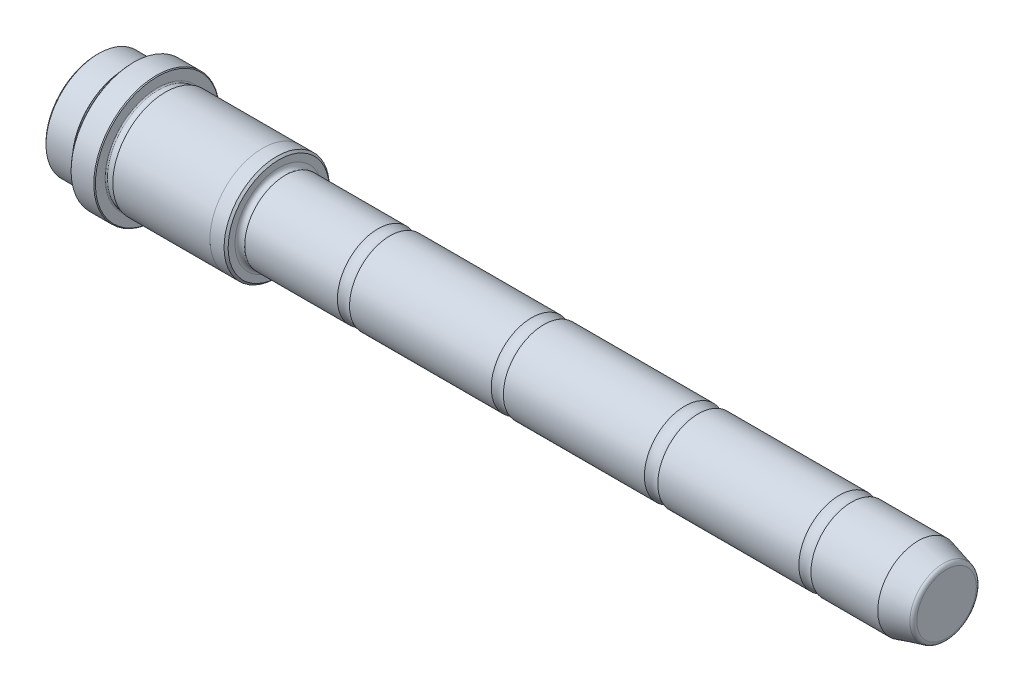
ISO-10303-21;
HEADER;
FILE_DESCRIPTION(('STEP AP214'),'2;1');
FILE_NAME('part.step','',(''),(''),'','','');
FILE_SCHEMA(('AUTOMOTIVE_DESIGN { 1 0 10303 214 1 1 1 1 }'));
ENDSEC;
DATA;
#1=APPLICATION_CONTEXT('core data for automotive mechanical design processes');
#2=APPLICATION_PROTOCOL_DEFINITION('international standard','automotive_design',2000,#1);
#3=PRODUCT_CONTEXT('',#1,'mechanical');
#4=PRODUCT('Part','Part','',(#3));
#5=PRODUCT_RELATED_PRODUCT_CATEGORY('part','',(#4));
#6=PRODUCT_DEFINITION_FORMATION('','',#4);
#7=PRODUCT_DEFINITION_CONTEXT('part definition',#1,'design');
#8=PRODUCT_DEFINITION('design','',#6,#7);
#9=PRODUCT_DEFINITION_SHAPE('','',#8);
#10=(LENGTH_UNIT() NAMED_UNIT(*) SI_UNIT(.MILLI.,.METRE.));
#11=(NAMED_UNIT(*) PLANE_ANGLE_UNIT() SI_UNIT($,.RADIAN.));
#12=(NAMED_UNIT(*) SI_UNIT($,.STERADIAN.) SOLID_ANGLE_UNIT());
#13=UNCERTAINTY_MEASURE_WITH_UNIT(LENGTH_MEASURE(1.E-05),#10,'distance_accuracy_value','');
#14=(GEOMETRIC_REPRESENTATION_CONTEXT(3) GLOBAL_UNCERTAINTY_ASSIGNED_CONTEXT((#13)) GLOBAL_UNIT_ASSIGNED_CONTEXT((#10,
#11,#12)) REPRESENTATION_CONTEXT('',''));
#15=CARTESIAN_POINT('',(0.,0.,0.));
#16=DIRECTION('',(0.,0.,1.));
#17=DIRECTION('',(1.,0.,0.));
#18=AXIS2_PLACEMENT_3D('',#15,#16,#17);
#19=CARTESIAN_POINT('',(165.,0.,0.));
#20=DIRECTION('',(1.,0.,0.));
#21=DIRECTION('',(0.,1.,0.));
#22=AXIS2_PLACEMENT_3D('',#19,#20,#21);
#23=CYLINDRICAL_SURFACE('',#22,9.99999999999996);
#24=CARTESIAN_POINT('',(1.59999999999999,0.,0.));
#25=DIRECTION('',(1.,0.,0.));
#26=DIRECTION('',(0.,1.,0.));
#27=AXIS2_PLACEMENT_3D('',#24,#25,#26);
#28=CIRCLE('',#27,9.99999999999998);
#29=CARTESIAN_POINT('',(1.59999999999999,9.99999999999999,0.));
#30=VERTEX_POINT('',#29);
#31=EDGE_CURVE('E105',#30,#30,#28,.T.);
#32=ORIENTED_EDGE('',*,*,#31,.T.);
#33=EDGE_LOOP('',(#32));
#34=FACE_BOUND('',#33,.T.);
#35=CARTESIAN_POINT('',(24.5033370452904,0.,0.));
#36=DIRECTION('',(-1.,0.,0.));
#37=DIRECTION('',(0.,-1.,0.));
#38=AXIS2_PLACEMENT_3D('',#35,#36,#37);
#39=CIRCLE('',#38,9.99999999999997);
#40=CARTESIAN_POINT('',(24.5033370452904,-9.99999999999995,0.));
#41=VERTEX_POINT('',#40);
#42=EDGE_CURVE('E132',#41,#41,#39,.T.);
#43=ORIENTED_EDGE('',*,*,#42,.T.);
#44=EDGE_LOOP('',(#43));
#45=FACE_BOUND('',#44,.T.);
#46=ADVANCED_FACE('F28',(#34,#45),#23,.T.);
#47=CARTESIAN_POINT('',(-45.,13.,0.));
#48=DIRECTION('',(-1.,0.,0.));
#49=DIRECTION('',(0.,-1.,0.));
#50=AXIS2_PLACEMENT_3D('',#47,#48,#49);
#51=PLANE('',#50);
#52=CARTESIAN_POINT('',(-45.,0.,0.));
#53=DIRECTION('',(-1.,0.,0.));
#54=DIRECTION('',(0.,-1.,0.));
#55=AXIS2_PLACEMENT_3D('',#52,#53,#54);
#56=CIRCLE('',#55,12.5000000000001);
#57=CARTESIAN_POINT('',(-45.,-12.5000000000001,0.));
#58=VERTEX_POINT('',#57);
#59=EDGE_CURVE('E39',#58,#58,#56,.T.);
#60=ORIENTED_EDGE('',*,*,#59,.T.);
#61=EDGE_LOOP('',(#60));
#62=FACE_BOUND('',#61,.T.);
#63=ADVANCED_FACE('F155',(#62),#51,.T.);
#64=CARTESIAN_POINT('',(165.,0.,0.));
#65=DIRECTION('',(1.,0.,0.));
#66=DIRECTION('',(0.,1.,0.));
#67=AXIS2_PLACEMENT_3D('',#64,#65,#66);
#68=CYLINDRICAL_SURFACE('',#67,13.);
#69=CARTESIAN_POINT('',(-44.5000000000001,0.,0.));
#70=DIRECTION('',(-1.,0.,0.));
#71=DIRECTION('',(0.,-1.,0.));
#72=AXIS2_PLACEMENT_3D('',#69,#70,#71);
#73=CIRCLE('',#72,13.);
#74=CARTESIAN_POINT('',(-44.5000000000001,-13.,0.));
#75=VERTEX_POINT('',#74);
#76=EDGE_CURVE('E43',#75,#75,#73,.F.);
#77=ORIENTED_EDGE('',*,*,#76,.T.);
#78=EDGE_LOOP('',(#77));
#79=FACE_BOUND('',#78,.T.);
#80=CARTESIAN_POINT('',(-38.,0.,0.));
#81=DIRECTION('',(1.,0.,0.));
#82=DIRECTION('',(0.,1.,0.));
#83=AXIS2_PLACEMENT_3D('',#80,#81,#82);
#84=CIRCLE('',#83,13.);
#85=CARTESIAN_POINT('',(-38.,13.,0.));
#86=VERTEX_POINT('',#85);
#87=EDGE_CURVE('E66',#86,#86,#84,.T.);
#88=ORIENTED_EDGE('',*,*,#87,.F.);
#89=EDGE_LOOP('',(#88));
#90=FACE_BOUND('',#89,.T.);
#91=ADVANCED_FACE('F163',(#79,#90),#68,.T.);
#92=CARTESIAN_POINT('',(-38.,12.9,0.));
#93=DIRECTION('',(1.,0.,0.));
#94=DIRECTION('',(0.,1.,0.));
#95=AXIS2_PLACEMENT_3D('',#92,#93,#94);
#96=PLANE('',#95);
#97=ORIENTED_EDGE('',*,*,#87,.T.);
#98=EDGE_LOOP('',(#97));
#99=FACE_BOUND('',#98,.T.);
#100=CARTESIAN_POINT('',(-38.,0.,0.));
#101=DIRECTION('',(1.,0.,0.));
#102=DIRECTION('',(0.,1.,0.));
#103=AXIS2_PLACEMENT_3D('',#100,#101,#102);
#104=CIRCLE('',#103,12.9);
#105=CARTESIAN_POINT('',(-38.,12.9,0.));
#106=VERTEX_POINT('',#105);
#107=EDGE_CURVE('E69',#106,#106,#104,.T.);
#108=ORIENTED_EDGE('',*,*,#107,.F.);
#109=EDGE_LOOP('',(#108));
#110=FACE_BOUND('',#109,.T.);
#111=ADVANCED_FACE('F430',(#99,#110),#96,.T.);
#112=CARTESIAN_POINT('',(-37.7,0.,0.));
#113=DIRECTION('',(1.,0.,0.));
#114=DIRECTION('',(0.,1.,0.));
#115=AXIS2_PLACEMENT_3D('',#112,#113,#114);
#116=TOROIDAL_SURFACE('',#115,12.9,0.299999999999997);
#117=ORIENTED_EDGE('',*,*,#107,.T.);
#118=EDGE_LOOP('',(#117));
#119=FACE_BOUND('',#118,.T.);
#120=CARTESIAN_POINT('',(-37.7,0.,0.));
#121=DIRECTION('',(1.,0.,0.));
#122=DIRECTION('',(0.,1.,0.));
#123=AXIS2_PLACEMENT_3D('',#120,#121,#122);
#124=CIRCLE('',#123,12.6);
#125=CARTESIAN_POINT('',(-37.7,12.6,0.));
#126=VERTEX_POINT('',#125);
#127=EDGE_CURVE('E72',#126,#126,#124,.T.);
#128=ORIENTED_EDGE('',*,*,#127,.F.);
#129=EDGE_LOOP('',(#128));
#130=FACE_BOUND('',#129,.T.);
#131=ADVANCED_FACE('F421',(#119,#130),#116,.F.);
#132=CARTESIAN_POINT('',(165.,0.,0.));
#133=DIRECTION('',(1.,0.,0.));
#134=DIRECTION('',(0.,1.,0.));
#135=AXIS2_PLACEMENT_3D('',#132,#133,#134);
#136=CYLINDRICAL_SURFACE('',#135,12.6);
#137=ORIENTED_EDGE('',*,*,#127,.T.);
#138=EDGE_LOOP('',(#137));
#139=FACE_BOUND('',#138,.T.);
#140=CARTESIAN_POINT('',(-36.3,0.,0.));
#141=DIRECTION('',(1.,0.,0.));
#142=DIRECTION('',(0.,1.,0.));
#143=AXIS2_PLACEMENT_3D('',#140,#141,#142);
#144=CIRCLE('',#143,12.6);
#145=CARTESIAN_POINT('',(-36.3,12.6,0.));
#146=VERTEX_POINT('',#145);
#147=EDGE_CURVE('E75',#146,#146,#144,.T.);
#148=ORIENTED_EDGE('',*,*,#147,.F.);
#149=EDGE_LOOP('',(#148));
#150=FACE_BOUND('',#149,.T.);
#151=ADVANCED_FACE('F412',(#139,#150),#136,.T.);
#152=CARTESIAN_POINT('',(-36.3,0.,0.));
#153=DIRECTION('',(1.,0.,0.));
#154=DIRECTION('',(0.,1.,0.));
#155=AXIS2_PLACEMENT_3D('',#152,#153,#154);
#156=TOROIDAL_SURFACE('',#155,12.9,0.300000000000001);
#157=ORIENTED_EDGE('',*,*,#147,.T.);
#158=EDGE_LOOP('',(#157));
#159=FACE_BOUND('',#158,.T.);
#160=CARTESIAN_POINT('',(-36.,0.,0.));
#161=DIRECTION('',(1.,0.,0.));
#162=DIRECTION('',(0.,1.,0.));
#163=AXIS2_PLACEMENT_3D('',#160,#161,#162);
#164=CIRCLE('',#163,12.9);
#165=CARTESIAN_POINT('',(-36.,12.9,0.));
#166=VERTEX_POINT('',#165);
#167=EDGE_CURVE('E78',#166,#166,#164,.T.);
#168=ORIENTED_EDGE('',*,*,#167,.F.);
#169=EDGE_LOOP('',(#168));
#170=FACE_BOUND('',#169,.T.);
#171=ADVANCED_FACE('F404',(#159,#170),#156,.F.);
#172=CARTESIAN_POINT('',(-36.,15.5,0.));
#173=DIRECTION('',(-1.,0.,0.));
#174=DIRECTION('',(0.,-1.,0.));
#175=AXIS2_PLACEMENT_3D('',#172,#173,#174);
#176=PLANE('',#175);
#177=CARTESIAN_POINT('',(-36.,0.,0.));
#178=DIRECTION('',(-1.,0.,0.));
#179=DIRECTION('',(0.,-1.,0.));
#180=AXIS2_PLACEMENT_3D('',#177,#178,#179);
#181=CIRCLE('',#180,15.3);
#182=CARTESIAN_POINT('',(-36.,15.3000000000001,0.));
#183=VERTEX_POINT('',#182);
#184=EDGE_CURVE('E51',#183,#183,#181,.T.);
#185=ORIENTED_EDGE('',*,*,#184,.T.);
#186=EDGE_LOOP('',(#185));
#187=FACE_BOUND('',#186,.T.);
#188=ORIENTED_EDGE('',*,*,#167,.T.);
#189=EDGE_LOOP('',(#188));
#190=FACE_BOUND('',#189,.T.);
#191=ADVANCED_FACE('F396',(#187,#190),#176,.T.);
#192=CARTESIAN_POINT('',(165.,0.,0.));
#193=DIRECTION('',(1.,0.,0.));
#194=DIRECTION('',(0.,1.,0.));
#195=AXIS2_PLACEMENT_3D('',#192,#193,#194);
#196=CYLINDRICAL_SURFACE('',#195,15.5);
#197=CARTESIAN_POINT('',(-35.8000000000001,0.,0.));
#198=DIRECTION('',(-1.,0.,0.));
#199=DIRECTION('',(0.,-1.,0.));
#200=AXIS2_PLACEMENT_3D('',#197,#198,#199);
#201=CIRCLE('',#200,15.5);
#202=CARTESIAN_POINT('',(-35.8000000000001,15.5,0.));
#203=VERTEX_POINT('',#202);
#204=EDGE_CURVE('E54',#203,#203,#201,.F.);
#205=ORIENTED_EDGE('',*,*,#204,.T.);
#206=EDGE_LOOP('',(#205));
#207=FACE_BOUND('',#206,.T.);
#208=CARTESIAN_POINT('',(-30.2,0.,0.));
#209=DIRECTION('',(1.,0.,0.));
#210=DIRECTION('',(0.,1.,0.));
#211=AXIS2_PLACEMENT_3D('',#208,#209,#210);
#212=CIRCLE('',#211,15.5);
#213=CARTESIAN_POINT('',(-30.2,15.5,0.));
#214=VERTEX_POINT('',#213);
#215=EDGE_CURVE('E57',#214,#214,#212,.F.);
#216=ORIENTED_EDGE('',*,*,#215,.T.);
#217=EDGE_LOOP('',(#216));
#218=FACE_BOUND('',#217,.T.);
#219=ADVANCED_FACE('F387',(#207,#218),#196,.T.);
#220=CARTESIAN_POINT('',(-30.,12.9,0.));
#221=DIRECTION('',(1.,0.,0.));
#222=DIRECTION('',(0.,1.,0.));
#223=AXIS2_PLACEMENT_3D('',#220,#221,#222);
#224=PLANE('',#223);
#225=CARTESIAN_POINT('',(-30.,0.,0.));
#226=DIRECTION('',(1.,0.,0.));
#227=DIRECTION('',(0.,1.,0.));
#228=AXIS2_PLACEMENT_3D('',#225,#226,#227);
#229=CIRCLE('',#228,15.2999999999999);
#230=CARTESIAN_POINT('',(-30.,15.2999999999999,0.));
#231=VERTEX_POINT('',#230);
#232=EDGE_CURVE('E48',#231,#231,#229,.T.);
#233=ORIENTED_EDGE('',*,*,#232,.T.);
#234=EDGE_LOOP('',(#233));
#235=FACE_BOUND('',#234,.T.);
#236=CARTESIAN_POINT('',(-30.,0.,0.));
#237=DIRECTION('',(1.,0.,0.));
#238=DIRECTION('',(0.,1.,0.));
#239=AXIS2_PLACEMENT_3D('',#236,#237,#238);
#240=CIRCLE('',#239,12.9);
#241=CARTESIAN_POINT('',(-30.,12.9,0.));
#242=VERTEX_POINT('',#241);
#243=EDGE_CURVE('E81',#242,#242,#240,.T.);
#244=ORIENTED_EDGE('',*,*,#243,.F.);
#245=EDGE_LOOP('',(#244));
#246=FACE_BOUND('',#245,.T.);
#247=ADVANCED_FACE('F378',(#235,#246),#224,.T.);
#248=CARTESIAN_POINT('',(-29.7,0.,0.));
#249=DIRECTION('',(1.,0.,0.));
#250=DIRECTION('',(0.,1.,0.));
#251=AXIS2_PLACEMENT_3D('',#248,#249,#250);
#252=TOROIDAL_SURFACE('',#251,12.9,0.300000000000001);
#253=ORIENTED_EDGE('',*,*,#243,.T.);
#254=EDGE_LOOP('',(#253));
#255=FACE_BOUND('',#254,.T.);
#256=CARTESIAN_POINT('',(-29.7,0.,0.));
#257=DIRECTION('',(1.,0.,0.));
#258=DIRECTION('',(0.,1.,0.));
#259=AXIS2_PLACEMENT_3D('',#256,#257,#258);
#260=CIRCLE('',#259,12.6);
#261=CARTESIAN_POINT('',(-29.7,12.6,0.));
#262=VERTEX_POINT('',#261);
#263=EDGE_CURVE('E84',#262,#262,#260,.T.);
#264=ORIENTED_EDGE('',*,*,#263,.F.);
#265=EDGE_LOOP('',(#264));
#266=FACE_BOUND('',#265,.T.);
#267=ADVANCED_FACE('F369',(#255,#266),#252,.F.);
#268=CARTESIAN_POINT('',(165.,0.,0.));
#269=DIRECTION('',(1.,0.,0.));
#270=DIRECTION('',(0.,1.,0.));
#271=AXIS2_PLACEMENT_3D('',#268,#269,#270);
#272=CYLINDRICAL_SURFACE('',#271,12.6);
#273=ORIENTED_EDGE('',*,*,#263,.T.);
#274=EDGE_LOOP('',(#273));
#275=FACE_BOUND('',#274,.T.);
#276=CARTESIAN_POINT('',(-28.3,0.,0.));
#277=DIRECTION('',(1.,0.,0.));
#278=DIRECTION('',(0.,1.,0.));
#279=AXIS2_PLACEMENT_3D('',#276,#277,#278);
#280=CIRCLE('',#279,12.6);
#281=CARTESIAN_POINT('',(-28.3,12.6,0.));
#282=VERTEX_POINT('',#281);
#283=EDGE_CURVE('E87',#282,#282,#280,.T.);
#284=ORIENTED_EDGE('',*,*,#283,.F.);
#285=EDGE_LOOP('',(#284));
#286=FACE_BOUND('',#285,.T.);
#287=ADVANCED_FACE('F360',(#275,#286),#272,.T.);
#288=CARTESIAN_POINT('',(-28.3,0.,0.));
#289=DIRECTION('',(1.,0.,0.));
#290=DIRECTION('',(0.,1.,0.));
#291=AXIS2_PLACEMENT_3D('',#288,#289,#290);
#292=TOROIDAL_SURFACE('',#291,12.9,0.300000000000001);
#293=ORIENTED_EDGE('',*,*,#283,.T.);
#294=EDGE_LOOP('',(#293));
#295=FACE_BOUND('',#294,.T.);
#296=CARTESIAN_POINT('',(-28.,0.,0.));
#297=DIRECTION('',(1.,0.,0.));
#298=DIRECTION('',(0.,1.,0.));
#299=AXIS2_PLACEMENT_3D('',#296,#297,#298);
#300=CIRCLE('',#299,12.9);
#301=CARTESIAN_POINT('',(-28.,12.9,0.));
#302=VERTEX_POINT('',#301);
#303=EDGE_CURVE('E90',#302,#302,#300,.T.);
#304=ORIENTED_EDGE('',*,*,#303,.F.);
#305=EDGE_LOOP('',(#304));
#306=FACE_BOUND('',#305,.T.);
#307=ADVANCED_FACE('F351',(#295,#306),#292,.F.);
#308=CARTESIAN_POINT('',(-28.,13.0001,0.));
#309=DIRECTION('',(-1.,0.,0.));
#310=DIRECTION('',(0.,-1.,0.));
#311=AXIS2_PLACEMENT_3D('',#308,#309,#310);
#312=PLANE('',#311);
#313=ORIENTED_EDGE('',*,*,#303,.T.);
#314=EDGE_LOOP('',(#313));
#315=FACE_BOUND('',#314,.T.);
#316=CARTESIAN_POINT('',(-28.,0.,0.));
#317=DIRECTION('',(1.,0.,0.));
#318=DIRECTION('',(0.,1.,0.));
#319=AXIS2_PLACEMENT_3D('',#316,#317,#318);
#320=CIRCLE('',#319,13.0001);
#321=CARTESIAN_POINT('',(-28.,13.0001,0.));
#322=VERTEX_POINT('',#321);
#323=EDGE_CURVE('E93',#322,#322,#320,.T.);
#324=ORIENTED_EDGE('',*,*,#323,.F.);
#325=EDGE_LOOP('',(#324));
#326=FACE_BOUND('',#325,.T.);
#327=ADVANCED_FACE('F342',(#315,#326),#312,.T.);
#328=CARTESIAN_POINT('',(165.,0.,0.));
#329=DIRECTION('',(1.,0.,0.));
#330=DIRECTION('',(0.,1.,0.));
#331=AXIS2_PLACEMENT_3D('',#328,#329,#330);
#332=CYLINDRICAL_SURFACE('',#331,13.0001);
#333=ORIENTED_EDGE('',*,*,#323,.T.);
#334=EDGE_LOOP('',(#333));
#335=FACE_BOUND('',#334,.T.);
#336=CARTESIAN_POINT('',(-4.,0.,0.));
#337=DIRECTION('',(1.,0.,0.));
#338=DIRECTION('',(0.,1.,0.));
#339=AXIS2_PLACEMENT_3D('',#336,#337,#338);
#340=CIRCLE('',#339,13.0001);
#341=CARTESIAN_POINT('',(-4.00000000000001,13.0001,0.));
#342=VERTEX_POINT('',#341);
#343=EDGE_CURVE('E96',#342,#342,#340,.T.);
#344=ORIENTED_EDGE('',*,*,#343,.F.);
#345=EDGE_LOOP('',(#344));
#346=FACE_BOUND('',#345,.T.);
#347=ADVANCED_FACE('F333',(#335,#346),#332,.T.);
#348=CARTESIAN_POINT('',(-4.,13.0001,0.));
#349=DIRECTION('',(1.,0.,0.));
#350=DIRECTION('',(0.,1.,0.));
#351=AXIS2_PLACEMENT_3D('',#348,#349,#350);
#352=PLANE('',#351);
#353=ORIENTED_EDGE('',*,*,#343,.T.);
#354=EDGE_LOOP('',(#353));
#355=FACE_BOUND('',#354,.T.);
#356=CARTESIAN_POINT('',(-4.,0.,0.));
#357=DIRECTION('',(1.,0.,0.));
#358=DIRECTION('',(0.,1.,0.));
#359=AXIS2_PLACEMENT_3D('',#356,#357,#358);
#360=CIRCLE('',#359,13.);
#361=CARTESIAN_POINT('',(-4.00000000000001,13.,0.));
#362=VERTEX_POINT('',#361);
#363=EDGE_CURVE('E99',#362,#362,#360,.T.);
#364=ORIENTED_EDGE('',*,*,#363,.F.);
#365=EDGE_LOOP('',(#364));
#366=FACE_BOUND('',#365,.T.);
#367=ADVANCED_FACE('F325',(#355,#366),#352,.T.);
#368=CARTESIAN_POINT('',(165.,0.,0.));
#369=DIRECTION('',(1.,0.,0.));
#370=DIRECTION('',(0.,1.,0.));
#371=AXIS2_PLACEMENT_3D('',#368,#369,#370);
#372=CYLINDRICAL_SURFACE('',#371,13.);
#373=CARTESIAN_POINT('',(-0.500000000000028,0.,0.));
#374=DIRECTION('',(1.,0.,0.));
#375=DIRECTION('',(0.,1.,0.));
#376=AXIS2_PLACEMENT_3D('',#373,#374,#375);
#377=CIRCLE('',#376,13.);
#378=CARTESIAN_POINT('',(-0.500000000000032,13.,0.));
#379=VERTEX_POINT('',#378);
#380=EDGE_CURVE('E10',#379,#379,#377,.F.);
#381=ORIENTED_EDGE('',*,*,#380,.T.);
#382=EDGE_LOOP('',(#381));
#383=FACE_BOUND('',#382,.T.);
#384=ORIENTED_EDGE('',*,*,#363,.T.);
#385=EDGE_LOOP('',(#384));
#386=FACE_BOUND('',#385,.T.);
#387=ADVANCED_FACE('F317',(#383,#386),#372,.T.);
#388=CARTESIAN_POINT('',(0.,10.8,0.));
#389=DIRECTION('',(1.,0.,0.));
#390=DIRECTION('',(0.,1.,0.));
#391=AXIS2_PLACEMENT_3D('',#388,#389,#390);
#392=PLANE('',#391);
#393=CARTESIAN_POINT('',(0.,0.,0.));
#394=DIRECTION('',(1.,0.,0.));
#395=DIRECTION('',(0.,1.,0.));
#396=AXIS2_PLACEMENT_3D('',#393,#394,#395);
#397=CIRCLE('',#396,12.4999999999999);
#398=CARTESIAN_POINT('',(0.,12.5,0.));
#399=VERTEX_POINT('',#398);
#400=EDGE_CURVE('E35',#399,#399,#397,.T.);
#401=ORIENTED_EDGE('',*,*,#400,.T.);
#402=EDGE_LOOP('',(#401));
#403=FACE_BOUND('',#402,.T.);
#404=CARTESIAN_POINT('',(0.,0.,0.));
#405=DIRECTION('',(1.,0.,0.));
#406=DIRECTION('',(0.,1.,0.));
#407=AXIS2_PLACEMENT_3D('',#404,#405,#406);
#408=CIRCLE('',#407,10.8);
#409=CARTESIAN_POINT('',(0.,10.8,0.));
#410=VERTEX_POINT('',#409);
#411=EDGE_CURVE('E102',#410,#410,#408,.T.);
#412=ORIENTED_EDGE('',*,*,#411,.F.);
#413=EDGE_LOOP('',(#412));
#414=FACE_BOUND('',#413,.T.);
#415=ADVANCED_FACE('F150',(#403,#414),#392,.T.);
#416=CARTESIAN_POINT('',(1.,0.,0.));
#417=DIRECTION('',(1.,0.,0.));
#418=DIRECTION('',(0.,1.,0.));
#419=AXIS2_PLACEMENT_3D('',#416,#417,#418);
#420=TOROIDAL_SURFACE('',#419,10.8,1.);
#421=ORIENTED_EDGE('',*,*,#411,.T.);
#422=EDGE_LOOP('',(#421));
#423=FACE_BOUND('',#422,.T.);
#424=ORIENTED_EDGE('',*,*,#31,.F.);
#425=EDGE_LOOP('',(#424));
#426=FACE_BOUND('',#425,.T.);
#427=ADVANCED_FACE('F140',(#423,#426),#420,.F.);
#428=CARTESIAN_POINT('',(26.,0.,0.));
#429=DIRECTION('',(-1.,0.,0.));
#430=DIRECTION('',(0.,-1.,0.));
#431=AXIS2_PLACEMENT_3D('',#428,#429,#430);
#432=TOROIDAL_SURFACE('',#431,12.6,3.);
#433=CARTESIAN_POINT('',(27.4966629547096,0.,0.));
#434=DIRECTION('',(-1.,0.,0.));
#435=DIRECTION('',(0.,-1.,0.));
#436=AXIS2_PLACEMENT_3D('',#433,#434,#435);
#437=CIRCLE('',#436,9.99999999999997);
#438=CARTESIAN_POINT('',(27.4966629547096,-9.99999999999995,0.));
#439=VERTEX_POINT('',#438);
#440=EDGE_CURVE('E129',#439,#439,#437,.T.);
#441=ORIENTED_EDGE('',*,*,#440,.T.);
#442=EDGE_LOOP('',(#441));
#443=FACE_BOUND('',#442,.T.);
#444=ORIENTED_EDGE('',*,*,#42,.F.);
#445=EDGE_LOOP('',(#444));
#446=FACE_BOUND('',#445,.T.);
#447=ADVANCED_FACE('F137',(#443,#446),#432,.F.);
#448=CARTESIAN_POINT('',(165.,8.12435565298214,0.));
#449=DIRECTION('',(1.,0.,0.));
#450=DIRECTION('',(0.,1.,0.));
#451=AXIS2_PLACEMENT_3D('',#448,#449,#450);
#452=PLANE('',#451);
#453=CARTESIAN_POINT('',(165.,0.,0.));
#454=DIRECTION('',(1.,0.,0.));
#455=DIRECTION('',(0.,1.,0.));
#456=AXIS2_PLACEMENT_3D('',#453,#454,#455);
#457=CIRCLE('',#456,7.35702866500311);
#458=CARTESIAN_POINT('',(165.,7.35702866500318,0.));
#459=VERTEX_POINT('',#458);
#460=EDGE_CURVE('E63',#459,#459,#457,.T.);
#461=ORIENTED_EDGE('',*,*,#460,.T.);
#462=EDGE_LOOP('',(#461));
#463=FACE_BOUND('',#462,.T.);
#464=ADVANCED_FACE('F139',(#463),#452,.T.);
#465=CARTESIAN_POINT('',(165.,0.,0.));
#466=DIRECTION('',(-1.,0.,0.));
#467=DIRECTION('',(0.,-1.,0.));
#468=AXIS2_PLACEMENT_3D('',#465,#466,#467);
#469=CONICAL_SURFACE('',#468,8.12435565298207,0.26179938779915);
#470=CARTESIAN_POINT('',(164.258819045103,0.,0.));
#471=DIRECTION('',(1.,0.,0.));
#472=DIRECTION('',(0.,1.,0.));
#473=AXIS2_PLACEMENT_3D('',#470,#471,#472);
#474=CIRCLE('',#473,8.32295449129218);
#475=CARTESIAN_POINT('',(164.258819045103,8.32295449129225,0.));
#476=VERTEX_POINT('',#475);
#477=EDGE_CURVE('E60',#476,#476,#474,.F.);
#478=ORIENTED_EDGE('',*,*,#477,.T.);
#479=EDGE_LOOP('',(#478));
#480=FACE_BOUND('',#479,.T.);
#481=CARTESIAN_POINT('',(158.,0.,0.));
#482=DIRECTION('',(1.,0.,0.));
#483=DIRECTION('',(0.,1.,0.));
#484=AXIS2_PLACEMENT_3D('',#481,#482,#483);
#485=CIRCLE('',#484,9.99999999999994);
#486=CARTESIAN_POINT('',(158.,10.,0.));
#487=VERTEX_POINT('',#486);
#488=EDGE_CURVE('E108',#487,#487,#485,.T.);
#489=ORIENTED_EDGE('',*,*,#488,.T.);
#490=EDGE_LOOP('',(#489));
#491=FACE_BOUND('',#490,.T.);
#492=ADVANCED_FACE('F147',(#480,#491),#469,.T.);
#493=ORIENTED_EDGE('',*,*,#488,.F.);
#494=EDGE_LOOP('',(#493));
#495=FACE_BOUND('',#494,.T.);
#496=CARTESIAN_POINT('',(141.49666295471,0.,0.));
#497=DIRECTION('',(-1.,0.,0.));
#498=DIRECTION('',(0.,-1.,0.));
#499=AXIS2_PLACEMENT_3D('',#496,#497,#498);
#500=CIRCLE('',#499,9.99999999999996);
#501=CARTESIAN_POINT('',(141.49666295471,-9.99999999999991,0.));
#502=VERTEX_POINT('',#501);
#503=EDGE_CURVE('E111',#502,#502,#500,.T.);
#504=ORIENTED_EDGE('',*,*,#503,.F.);
#505=EDGE_LOOP('',(#504));
#506=FACE_BOUND('',#505,.T.);
#507=ADVANCED_FACE('F159',(#495,#506),#23,.T.);
#508=CARTESIAN_POINT('',(140.,0.,0.));
#509=DIRECTION('',(-1.,0.,0.));
#510=DIRECTION('',(0.,-1.,0.));
#511=AXIS2_PLACEMENT_3D('',#508,#509,#510);
#512=TOROIDAL_SURFACE('',#511,12.6,3.);
#513=ORIENTED_EDGE('',*,*,#503,.T.);
#514=EDGE_LOOP('',(#513));
#515=FACE_BOUND('',#514,.T.);
#516=CARTESIAN_POINT('',(138.50333704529,0.,0.));
#517=DIRECTION('',(-1.,0.,0.));
#518=DIRECTION('',(0.,-1.,0.));
#519=AXIS2_PLACEMENT_3D('',#516,#517,#518);
#520=CIRCLE('',#519,9.99999999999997);
#521=CARTESIAN_POINT('',(138.50333704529,-9.99999999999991,0.));
#522=VERTEX_POINT('',#521);
#523=EDGE_CURVE('E114',#522,#522,#520,.T.);
#524=ORIENTED_EDGE('',*,*,#523,.F.);
#525=EDGE_LOOP('',(#524));
#526=FACE_BOUND('',#525,.T.);
#527=ADVANCED_FACE('F173',(#515,#526),#512,.F.);
#528=ORIENTED_EDGE('',*,*,#523,.T.);
#529=EDGE_LOOP('',(#528));
#530=FACE_BOUND('',#529,.T.);
#531=CARTESIAN_POINT('',(103.658312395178,0.,0.));
#532=DIRECTION('',(-1.,0.,0.));
#533=DIRECTION('',(0.,-1.,0.));
#534=AXIS2_PLACEMENT_3D('',#531,#532,#533);
#535=CIRCLE('',#534,9.99999999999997);
#536=CARTESIAN_POINT('',(103.658312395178,-9.99999999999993,0.));
#537=VERTEX_POINT('',#536);
#538=EDGE_CURVE('E117',#537,#537,#535,.T.);
#539=ORIENTED_EDGE('',*,*,#538,.F.);
#540=EDGE_LOOP('',(#539));
#541=FACE_BOUND('',#540,.T.);
#542=ADVANCED_FACE('F175',(#530,#541),#23,.T.);
#543=CARTESIAN_POINT('',(102.,0.,0.));
#544=DIRECTION('',(-1.,0.,0.));
#545=DIRECTION('',(0.,-1.,0.));
#546=AXIS2_PLACEMENT_3D('',#543,#544,#545);
#547=TOROIDAL_SURFACE('',#546,12.5,3.);
#548=ORIENTED_EDGE('',*,*,#538,.T.);
#549=EDGE_LOOP('',(#548));
#550=FACE_BOUND('',#549,.T.);
#551=CARTESIAN_POINT('',(100.341687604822,0.,0.));
#552=DIRECTION('',(-1.,0.,0.));
#553=DIRECTION('',(0.,-1.,0.));
#554=AXIS2_PLACEMENT_3D('',#551,#552,#553);
#555=CIRCLE('',#554,9.99999999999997);
#556=CARTESIAN_POINT('',(100.341687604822,-9.99999999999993,0.));
#557=VERTEX_POINT('',#556);
#558=EDGE_CURVE('E120',#557,#557,#555,.T.);
#559=ORIENTED_EDGE('',*,*,#558,.F.);
#560=EDGE_LOOP('',(#559));
#561=FACE_BOUND('',#560,.T.);
#562=ADVANCED_FACE('F186',(#550,#561),#547,.F.);
#563=ORIENTED_EDGE('',*,*,#558,.T.);
#564=EDGE_LOOP('',(#563));
#565=FACE_BOUND('',#564,.T.);
#566=CARTESIAN_POINT('',(65.4966629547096,0.,0.));
#567=DIRECTION('',(-1.,0.,0.));
#568=DIRECTION('',(0.,-1.,0.));
#569=AXIS2_PLACEMENT_3D('',#566,#567,#568);
#570=CIRCLE('',#569,9.99999999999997);
#571=CARTESIAN_POINT('',(65.4966629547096,-9.99999999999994,0.));
#572=VERTEX_POINT('',#571);
#573=EDGE_CURVE('E123',#572,#572,#570,.T.);
#574=ORIENTED_EDGE('',*,*,#573,.F.);
#575=EDGE_LOOP('',(#574));
#576=FACE_BOUND('',#575,.T.);
#577=ADVANCED_FACE('F171',(#565,#576),#23,.T.);
#578=CARTESIAN_POINT('',(64.,0.,0.));
#579=DIRECTION('',(-1.,0.,0.));
#580=DIRECTION('',(0.,-1.,0.));
#581=AXIS2_PLACEMENT_3D('',#578,#579,#580);
#582=TOROIDAL_SURFACE('',#581,12.6,3.);
#583=ORIENTED_EDGE('',*,*,#573,.T.);
#584=EDGE_LOOP('',(#583));
#585=FACE_BOUND('',#584,.T.);
#586=CARTESIAN_POINT('',(62.5033370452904,0.,0.));
#587=DIRECTION('',(-1.,0.,0.));
#588=DIRECTION('',(0.,-1.,0.));
#589=AXIS2_PLACEMENT_3D('',#586,#587,#588);
#590=CIRCLE('',#589,9.99999999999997);
#591=CARTESIAN_POINT('',(62.5033370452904,-9.99999999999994,0.));
#592=VERTEX_POINT('',#591);
#593=EDGE_CURVE('E126',#592,#592,#590,.T.);
#594=ORIENTED_EDGE('',*,*,#593,.F.);
#595=EDGE_LOOP('',(#594));
#596=FACE_BOUND('',#595,.T.);
#597=ADVANCED_FACE('F169',(#585,#596),#582,.F.);
#598=ORIENTED_EDGE('',*,*,#593,.T.);
#599=EDGE_LOOP('',(#598));
#600=FACE_BOUND('',#599,.T.);
#601=ORIENTED_EDGE('',*,*,#440,.F.);
#602=EDGE_LOOP('',(#601));
#603=FACE_BOUND('',#602,.T.);
#604=ADVANCED_FACE('F158',(#600,#603),#23,.T.);
#605=CARTESIAN_POINT('',(164.,0.,0.));
#606=DIRECTION('',(1.,0.,0.));
#607=DIRECTION('',(0.,1.,0.));
#608=AXIS2_PLACEMENT_3D('',#605,#606,#607);
#609=TOROIDAL_SURFACE('',#608,7.35702866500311,1.);
#610=ORIENTED_EDGE('',*,*,#477,.F.);
#611=EDGE_LOOP('',(#610));
#612=FACE_BOUND('',#611,.T.);
#613=ORIENTED_EDGE('',*,*,#460,.F.);
#614=EDGE_LOOP('',(#613));
#615=FACE_BOUND('',#614,.T.);
#616=ADVANCED_FACE('F168',(#612,#615),#609,.T.);
#617=CARTESIAN_POINT('',(-35.8000000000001,0.,0.));
#618=DIRECTION('',(1.,0.,0.));
#619=DIRECTION('',(0.,1.,0.));
#620=AXIS2_PLACEMENT_3D('',#617,#618,#619);
#621=CONICAL_SURFACE('',#620,15.5,0.785398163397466);
#622=CARTESIAN_POINT('',(-36.,15.3000000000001,0.));
#623=CARTESIAN_POINT('',(-35.9979166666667,15.3020833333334,0.));
#624=CARTESIAN_POINT('',(-35.9958333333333,15.3041666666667,0.));
#625=CARTESIAN_POINT('',(-35.9916666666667,15.3083333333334,0.));
#626=CARTESIAN_POINT('',(-35.9895833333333,15.3104166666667,0.));
#627=CARTESIAN_POINT('',(-35.9854166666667,15.3145833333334,0.));
#628=CARTESIAN_POINT('',(-35.9833333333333,15.3166666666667,0.));
#629=CARTESIAN_POINT('',(-35.9791666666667,15.3208333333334,0.));
#630=CARTESIAN_POINT('',(-35.9770833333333,15.3229166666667,0.));
#631=CARTESIAN_POINT('',(-35.9729166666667,15.3270833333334,0.));
#632=CARTESIAN_POINT('',(-35.9708333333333,15.3291666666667,0.));
#633=CARTESIAN_POINT('',(-35.9666666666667,15.3333333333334,0.));
#634=CARTESIAN_POINT('',(-35.9645833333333,15.3354166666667,0.));
#635=CARTESIAN_POINT('',(-35.9604166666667,15.3395833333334,0.));
#636=CARTESIAN_POINT('',(-35.9583333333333,15.3416666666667,0.));
#637=CARTESIAN_POINT('',(-35.9541666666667,15.3458333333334,0.));
#638=CARTESIAN_POINT('',(-35.9520833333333,15.3479166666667,0.));
#639=CARTESIAN_POINT('',(-35.9479166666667,15.3520833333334,0.));
#640=CARTESIAN_POINT('',(-35.9458333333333,15.3541666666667,0.));
#641=CARTESIAN_POINT('',(-35.9416666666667,15.3583333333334,0.));
#642=CARTESIAN_POINT('',(-35.9395833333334,15.3604166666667,0.));
#643=CARTESIAN_POINT('',(-35.9354166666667,15.3645833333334,0.));
#644=CARTESIAN_POINT('',(-35.9333333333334,15.3666666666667,0.));
#645=CARTESIAN_POINT('',(-35.9291666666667,15.3708333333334,0.));
#646=CARTESIAN_POINT('',(-35.9270833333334,15.3729166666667,0.));
#647=CARTESIAN_POINT('',(-35.9229166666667,15.3770833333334,0.));
#648=CARTESIAN_POINT('',(-35.9208333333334,15.3791666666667,0.));
#649=CARTESIAN_POINT('',(-35.9166666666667,15.3833333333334,0.));
#650=CARTESIAN_POINT('',(-35.9145833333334,15.3854166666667,0.));
#651=CARTESIAN_POINT('',(-35.9104166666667,15.3895833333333,0.));
#652=CARTESIAN_POINT('',(-35.9083333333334,15.3916666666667,0.));
#653=CARTESIAN_POINT('',(-35.9041666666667,15.3958333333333,0.));
#654=CARTESIAN_POINT('',(-35.9020833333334,15.3979166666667,0.));
#655=CARTESIAN_POINT('',(-35.8979166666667,15.4020833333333,0.));
#656=CARTESIAN_POINT('',(-35.8958333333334,15.4041666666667,0.));
#657=CARTESIAN_POINT('',(-35.8916666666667,15.4083333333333,0.));
#658=CARTESIAN_POINT('',(-35.8895833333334,15.4104166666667,0.));
#659=CARTESIAN_POINT('',(-35.8854166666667,15.4145833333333,0.));
#660=CARTESIAN_POINT('',(-35.8833333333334,15.4166666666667,0.));
#661=CARTESIAN_POINT('',(-35.8791666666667,15.4208333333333,0.));
#662=CARTESIAN_POINT('',(-35.8770833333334,15.4229166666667,0.));
#663=CARTESIAN_POINT('',(-35.8729166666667,15.4270833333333,0.));
#664=CARTESIAN_POINT('',(-35.8708333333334,15.4291666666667,0.));
#665=CARTESIAN_POINT('',(-35.8666666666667,15.4333333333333,0.));
#666=CARTESIAN_POINT('',(-35.8645833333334,15.4354166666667,0.));
#667=CARTESIAN_POINT('',(-35.8604166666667,15.4395833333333,0.));
#668=CARTESIAN_POINT('',(-35.8583333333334,15.4416666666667,0.));
#669=CARTESIAN_POINT('',(-35.8541666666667,15.4458333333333,0.));
#670=CARTESIAN_POINT('',(-35.8520833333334,15.4479166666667,0.));
#671=CARTESIAN_POINT('',(-35.8479166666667,15.4520833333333,0.));
#672=CARTESIAN_POINT('',(-35.8458333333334,15.4541666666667,0.));
#673=CARTESIAN_POINT('',(-35.8416666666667,15.4583333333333,0.));
#674=CARTESIAN_POINT('',(-35.8395833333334,15.4604166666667,0.));
#675=CARTESIAN_POINT('',(-35.8354166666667,15.4645833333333,0.));
#676=CARTESIAN_POINT('',(-35.8333333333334,15.4666666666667,0.));
#677=CARTESIAN_POINT('',(-35.8291666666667,15.4708333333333,0.));
#678=CARTESIAN_POINT('',(-35.8270833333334,15.4729166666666,0.));
#679=CARTESIAN_POINT('',(-35.8229166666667,15.4770833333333,0.));
#680=CARTESIAN_POINT('',(-35.8208333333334,15.4791666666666,0.));
#681=CARTESIAN_POINT('',(-35.8166666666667,15.4833333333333,0.));
#682=CARTESIAN_POINT('',(-35.8145833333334,15.4854166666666,0.));
#683=CARTESIAN_POINT('',(-35.8104166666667,15.4895833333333,0.));
#684=CARTESIAN_POINT('',(-35.8083333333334,15.4916666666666,0.));
#685=CARTESIAN_POINT('',(-35.8041666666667,15.4958333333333,0.));
#686=CARTESIAN_POINT('',(-35.8020833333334,15.4979166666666,0.));
#687=CARTESIAN_POINT('',(-35.8000000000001,15.5,0.));
#688=B_SPLINE_CURVE_WITH_KNOTS('',3,(#622,#623,#624,#625,#626,#627,#628,#629,#630,#631,#632,
#633,#634,#635,#636,#637,#638,#639,#640,#641,#642,#643,#644,#645,#646,#647,#648,#649,#650,#651,
#652,#653,#654,#655,#656,#657,#658,#659,#660,#661,#662,#663,#664,#665,#666,#667,#668,#669,#670,
#671,#672,#673,#674,#675,#676,#677,#678,#679,#680,#681,#682,#683,#684,#685,#686,#687),
.UNSPECIFIED.,.F.,.F.,(4,2,2,2,2,2,2,2,2,2,2,2,2,2,2,2,2,2,2,2,2,2,2,2,2,2,2,2,2,2,2,2,4),(0.,
0.00883883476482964,0.0176776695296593,0.0265165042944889,0.0353553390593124,0.0441941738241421,
0.0530330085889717,0.0618718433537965,0.0707106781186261,0.0795495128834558,0.0883883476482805,
0.0972271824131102,0.106066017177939,0.114904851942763,0.123743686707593,0.132582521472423,
0.141421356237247,0.150260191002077,0.159099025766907,0.167937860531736,0.17677669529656,
0.185615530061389,0.194454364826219,0.203293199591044,0.212132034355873,0.220970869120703,
0.229809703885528,0.238648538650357,0.247487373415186,0.256326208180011,0.26516504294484,
0.27400387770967,0.282842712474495),.UNSPECIFIED.);
#689=EDGE_CURVE('BSEAM221',#183,#203,#688,.T.);
#690=ORIENTED_EDGE('',*,*,#184,.F.);
#691=ORIENTED_EDGE('',*,*,#204,.F.);
#692=ORIENTED_EDGE('',*,*,#689,.T.);
#693=ORIENTED_EDGE('',*,*,#689,.F.);
#694=EDGE_LOOP('',(#690,#692,#691,#693));
#695=FACE_BOUND('',#694,.T.);
#696=ADVANCED_FACE('F221',(#695),#621,.T.);
#697=CARTESIAN_POINT('',(-30.,0.,0.));
#698=DIRECTION('',(-1.,0.,0.));
#699=DIRECTION('',(0.,-1.,0.));
#700=AXIS2_PLACEMENT_3D('',#697,#698,#699);
#701=CONICAL_SURFACE('',#700,15.2999999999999,0.785398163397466);
#702=ORIENTED_EDGE('',*,*,#215,.F.);
#703=EDGE_LOOP('',(#702));
#704=FACE_BOUND('',#703,.T.);
#705=ORIENTED_EDGE('',*,*,#232,.F.);
#706=EDGE_LOOP('',(#705));
#707=FACE_BOUND('',#706,.T.);
#708=ADVANCED_FACE('F231',(#704,#707),#701,.T.);
#709=CARTESIAN_POINT('',(-44.5000000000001,0.,0.));
#710=DIRECTION('',(1.,0.,0.));
#711=DIRECTION('',(0.,1.,0.));
#712=AXIS2_PLACEMENT_3D('',#709,#710,#711);
#713=CONICAL_SURFACE('',#712,13.,0.785398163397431);
#714=ORIENTED_EDGE('',*,*,#59,.F.);
#715=EDGE_LOOP('',(#714));
#716=FACE_BOUND('',#715,.T.);
#717=ORIENTED_EDGE('',*,*,#76,.F.);
#718=EDGE_LOOP('',(#717));
#719=FACE_BOUND('',#718,.T.);
#720=ADVANCED_FACE('F240',(#716,#719),#713,.T.);
#721=CARTESIAN_POINT('',(0.,0.,0.));
#722=DIRECTION('',(-1.,0.,0.));
#723=DIRECTION('',(0.,-1.,0.));
#724=AXIS2_PLACEMENT_3D('',#721,#722,#723);
#725=CONICAL_SURFACE('',#724,12.5,0.785398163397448);
#726=ORIENTED_EDGE('',*,*,#380,.F.);
#727=EDGE_LOOP('',(#726));
#728=FACE_BOUND('',#727,.T.);
#729=ORIENTED_EDGE('',*,*,#400,.F.);
#730=EDGE_LOOP('',(#729));
#731=FACE_BOUND('',#730,.T.);
#732=ADVANCED_FACE('F30',(#728,#731),#725,.T.);
#733=CLOSED_SHELL('',(#46,#63,#91,#111,#131,#151,#171,#191,#219,#247,#267,#287,#307,#327,#347,
#367,#387,#415,#427,#447,#464,#492,#507,#527,#542,#562,#577,#597,#604,#616,#696,#708,#720,#732));
#734=MANIFOLD_SOLID_BREP('B2',#733);
#735=ADVANCED_BREP_SHAPE_REPRESENTATION('',(#18,#734),#14);
#736=SHAPE_DEFINITION_REPRESENTATION(#9,#735);
ENDSEC;
END-ISO-10303-21;
